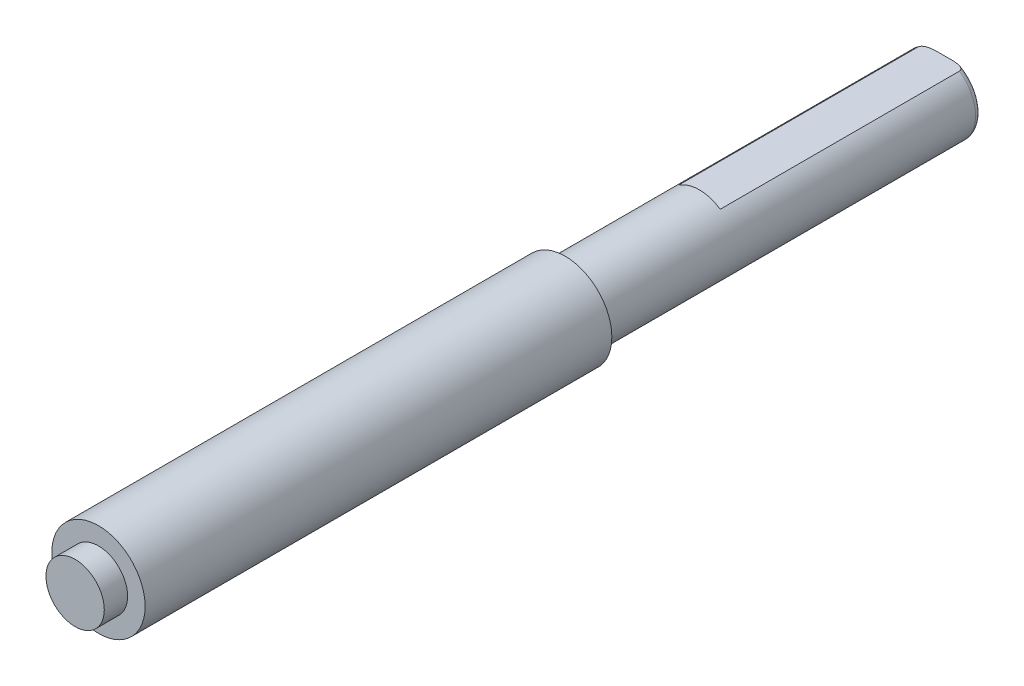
ISO-10303-21;
HEADER;
FILE_DESCRIPTION(('STEP AP214'),'2;1');
FILE_NAME('part.step','',(''),(''),'','','');
FILE_SCHEMA(('AUTOMOTIVE_DESIGN { 1 0 10303 214 1 1 1 1 }'));
ENDSEC;
DATA;
#1=APPLICATION_CONTEXT('core data for automotive mechanical design processes');
#2=APPLICATION_PROTOCOL_DEFINITION('international standard','automotive_design',2000,#1);
#3=PRODUCT_CONTEXT('',#1,'mechanical');
#4=PRODUCT('Part','Part','',(#3));
#5=PRODUCT_RELATED_PRODUCT_CATEGORY('part','',(#4));
#6=PRODUCT_DEFINITION_FORMATION('','',#4);
#7=PRODUCT_DEFINITION_CONTEXT('part definition',#1,'design');
#8=PRODUCT_DEFINITION('design','',#6,#7);
#9=PRODUCT_DEFINITION_SHAPE('','',#8);
#10=(LENGTH_UNIT() NAMED_UNIT(*) SI_UNIT(.MILLI.,.METRE.));
#11=(NAMED_UNIT(*) PLANE_ANGLE_UNIT() SI_UNIT($,.RADIAN.));
#12=(NAMED_UNIT(*) SI_UNIT($,.STERADIAN.) SOLID_ANGLE_UNIT());
#13=UNCERTAINTY_MEASURE_WITH_UNIT(LENGTH_MEASURE(1.E-05),#10,'distance_accuracy_value','');
#14=(GEOMETRIC_REPRESENTATION_CONTEXT(3) GLOBAL_UNCERTAINTY_ASSIGNED_CONTEXT((#13)) GLOBAL_UNIT_ASSIGNED_CONTEXT((#10,
#11,#12)) REPRESENTATION_CONTEXT('',''));
#15=CARTESIAN_POINT('',(0.,0.,0.));
#16=DIRECTION('',(0.,0.,1.));
#17=DIRECTION('',(1.,0.,0.));
#18=AXIS2_PLACEMENT_3D('',#15,#16,#17);
#19=CARTESIAN_POINT('',(0.,0.,72.5));
#20=DIRECTION('',(0.,0.,1.));
#21=DIRECTION('',(1.,0.,0.));
#22=AXIS2_PLACEMENT_3D('',#19,#20,#21);
#23=PLANE('',#22);
#24=CARTESIAN_POINT('',(0.,0.,72.5));
#25=DIRECTION('',(0.,0.,1.));
#26=DIRECTION('',(1.,0.,0.));
#27=AXIS2_PLACEMENT_3D('',#24,#25,#26);
#28=CIRCLE('',#27,4.);
#29=CARTESIAN_POINT('',(4.,0.,72.5));
#30=VERTEX_POINT('',#29);
#31=EDGE_CURVE('E88',#30,#30,#28,.T.);
#32=ORIENTED_EDGE('',*,*,#31,.T.);
#33=EDGE_LOOP('',(#32));
#34=FACE_BOUND('',#33,.T.);
#35=CARTESIAN_POINT('',(0.,0.,72.5));
#36=DIRECTION('',(0.,0.,1.));
#37=DIRECTION('',(1.,0.,0.));
#38=AXIS2_PLACEMENT_3D('',#35,#36,#37);
#39=CIRCLE('',#38,2.5);
#40=CARTESIAN_POINT('',(2.5,0.,72.5));
#41=VERTEX_POINT('',#40);
#42=EDGE_CURVE('E201',#41,#41,#39,.T.);
#43=ORIENTED_EDGE('',*,*,#42,.F.);
#44=EDGE_LOOP('',(#43));
#45=FACE_BOUND('',#44,.T.);
#46=ADVANCED_FACE('F33',(#34,#45),#23,.T.);
#47=CARTESIAN_POINT('',(0.,0.,32.5));
#48=DIRECTION('',(0.,0.,-1.));
#49=DIRECTION('',(-1.,0.,0.));
#50=AXIS2_PLACEMENT_3D('',#47,#48,#49);
#51=CYLINDRICAL_SURFACE('',#50,3.175);
#52=CARTESIAN_POINT('',(0.,0.,32.5));
#53=DIRECTION('',(0.,0.,1.));
#54=DIRECTION('',(1.,0.,0.));
#55=AXIS2_PLACEMENT_3D('',#52,#53,#54);
#56=CIRCLE('',#55,3.175);
#57=CARTESIAN_POINT('',(3.175,0.,32.5));
#58=VERTEX_POINT('',#57);
#59=EDGE_CURVE('E91',#58,#58,#56,.T.);
#60=ORIENTED_EDGE('',*,*,#59,.F.);
#61=EDGE_LOOP('',(#60));
#62=FACE_BOUND('',#61,.T.);
#63=DIRECTION('',(0.,0.,-1.));
#64=VECTOR('',#63,1.);
#65=CARTESIAN_POINT('',(-1.78605710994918,2.625,21.));
#66=LINE('',#65,#64);
#67=CARTESIAN_POINT('',(-1.78605710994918,2.625,21.));
#68=VERTEX_POINT('',#67);
#69=CARTESIAN_POINT('',(-1.78605710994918,2.625,0.500000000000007));
#70=VERTEX_POINT('',#69);
#71=EDGE_CURVE('E77',#68,#70,#66,.T.);
#72=ORIENTED_EDGE('',*,*,#71,.T.);
#73=CARTESIAN_POINT('',(0.,0.,0.5));
#74=DIRECTION('',(0.,0.,1.));
#75=DIRECTION('',(1.,0.,0.));
#76=AXIS2_PLACEMENT_3D('',#73,#74,#75);
#77=CIRCLE('',#76,3.175);
#78=CARTESIAN_POINT('',(1.78605710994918,2.625,0.500000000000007));
#79=VERTEX_POINT('',#78);
#80=EDGE_CURVE('E82',#70,#79,#77,.T.);
#81=ORIENTED_EDGE('',*,*,#80,.T.);
#82=DIRECTION('',(0.,0.,-1.));
#83=VECTOR('',#82,1.);
#84=CARTESIAN_POINT('',(1.78605710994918,2.625,21.));
#85=LINE('',#84,#83);
#86=CARTESIAN_POINT('',(1.78605710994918,2.625,21.));
#87=VERTEX_POINT('',#86);
#88=EDGE_CURVE('E76',#87,#79,#85,.T.);
#89=ORIENTED_EDGE('',*,*,#88,.F.);
#90=CARTESIAN_POINT('',(0.,0.,21.));
#91=DIRECTION('',(0.,0.,-1.));
#92=DIRECTION('',(-1.,0.,0.));
#93=AXIS2_PLACEMENT_3D('',#90,#91,#92);
#94=CIRCLE('',#93,3.175);
#95=EDGE_CURVE('E66',#68,#87,#94,.T.);
#96=ORIENTED_EDGE('',*,*,#95,.F.);
#97=EDGE_LOOP('',(#72,#81,#89,#96));
#98=FACE_BOUND('',#97,.T.);
#99=ADVANCED_FACE('F80',(#62,#98),#51,.T.);
#100=CARTESIAN_POINT('',(0.,0.,0.));
#101=DIRECTION('',(0.,0.,1.));
#102=DIRECTION('',(1.,0.,0.));
#103=AXIS2_PLACEMENT_3D('',#100,#101,#102);
#104=PLANE('',#103);
#105=DIRECTION('',(-1.,0.,0.));
#106=VECTOR('',#105,1.);
#107=CARTESIAN_POINT('',(1.78605710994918,2.625,0.));
#108=LINE('',#107,#106);
#109=CARTESIAN_POINT('',(0.514781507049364,2.625,0.));
#110=VERTEX_POINT('',#109);
#111=CARTESIAN_POINT('',(-0.514781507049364,2.625,0.));
#112=VERTEX_POINT('',#111);
#113=EDGE_CURVE('E73',#110,#112,#108,.T.);
#114=ORIENTED_EDGE('',*,*,#113,.F.);
#115=CARTESIAN_POINT('',(0.,0.,0.));
#116=DIRECTION('',(0.,0.,1.));
#117=DIRECTION('',(1.,0.,0.));
#118=AXIS2_PLACEMENT_3D('',#115,#116,#117);
#119=CIRCLE('',#118,2.675);
#120=EDGE_CURVE('E11',#110,#112,#119,.F.);
#121=ORIENTED_EDGE('',*,*,#120,.T.);
#122=EDGE_LOOP('',(#114,#121));
#123=FACE_BOUND('',#122,.T.);
#124=ADVANCED_FACE('F118',(#123),#104,.F.);
#125=CARTESIAN_POINT('',(0.,0.,32.5));
#126=DIRECTION('',(0.,0.,1.));
#127=DIRECTION('',(1.,0.,0.));
#128=AXIS2_PLACEMENT_3D('',#125,#126,#127);
#129=PLANE('',#128);
#130=CARTESIAN_POINT('',(0.,0.,32.5));
#131=DIRECTION('',(0.,0.,1.));
#132=DIRECTION('',(1.,0.,0.));
#133=AXIS2_PLACEMENT_3D('',#130,#131,#132);
#134=CIRCLE('',#133,4.);
#135=CARTESIAN_POINT('',(4.,0.,32.5));
#136=VERTEX_POINT('',#135);
#137=EDGE_CURVE('E84',#136,#136,#134,.T.);
#138=ORIENTED_EDGE('',*,*,#137,.F.);
#139=EDGE_LOOP('',(#138));
#140=FACE_BOUND('',#139,.T.);
#141=ORIENTED_EDGE('',*,*,#59,.T.);
#142=EDGE_LOOP('',(#141));
#143=FACE_BOUND('',#142,.T.);
#144=ADVANCED_FACE('F115',(#140,#143),#129,.F.);
#145=CARTESIAN_POINT('',(0.,0.,72.5));
#146=DIRECTION('',(0.,0.,-1.));
#147=DIRECTION('',(-1.,0.,0.));
#148=AXIS2_PLACEMENT_3D('',#145,#146,#147);
#149=CYLINDRICAL_SURFACE('',#148,4.);
#150=ORIENTED_EDGE('',*,*,#31,.F.);
#151=EDGE_LOOP('',(#150));
#152=FACE_BOUND('',#151,.T.);
#153=ORIENTED_EDGE('',*,*,#137,.T.);
#154=EDGE_LOOP('',(#153));
#155=FACE_BOUND('',#154,.T.);
#156=ADVANCED_FACE('F109',(#152,#155),#149,.T.);
#157=CARTESIAN_POINT('',(1.78605710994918,2.625,21.));
#158=DIRECTION('',(0.,-1.,0.));
#159=DIRECTION('',(0.,0.,-1.));
#160=AXIS2_PLACEMENT_3D('',#157,#158,#159);
#161=PLANE('',#160);
#162=ORIENTED_EDGE('',*,*,#88,.T.);
#163=CARTESIAN_POINT('',(1.78605710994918,2.625,0.5));
#164=CARTESIAN_POINT('',(1.7861183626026,2.625,0.480515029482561));
#165=CARTESIAN_POINT('',(1.78403706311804,2.625,0.461106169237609));
#166=CARTESIAN_POINT('',(1.77614566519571,2.625,0.423291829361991));
#167=CARTESIAN_POINT('',(1.77038040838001,2.625,0.404877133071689));
#168=CARTESIAN_POINT('',(1.75568721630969,2.625,0.369486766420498));
#169=CARTESIAN_POINT('',(1.74677356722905,2.625,0.352505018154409));
#170=CARTESIAN_POINT('',(1.72641804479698,2.625,0.320088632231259));
#171=CARTESIAN_POINT('',(1.71496821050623,2.625,0.304659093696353));
#172=CARTESIAN_POINT('',(1.68383170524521,2.625,0.26803343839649));
#173=CARTESIAN_POINT('',(1.66291485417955,2.625,0.247887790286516));
#174=CARTESIAN_POINT('',(1.61825721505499,2.625,0.211090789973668));
#175=CARTESIAN_POINT('',(1.59451232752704,2.625,0.194444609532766));
#176=CARTESIAN_POINT('',(1.52776741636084,2.625,0.153457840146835));
#177=CARTESIAN_POINT('',(1.48301267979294,2.625,0.131986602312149));
#178=CARTESIAN_POINT('',(1.41389871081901,2.625,0.104695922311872));
#179=CARTESIAN_POINT('',(1.39041958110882,2.625,0.0963921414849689));
#180=CARTESIAN_POINT('',(1.34299986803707,2.625,0.0812423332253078));
#181=CARTESIAN_POINT('',(1.31905952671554,2.625,0.074395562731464));
#182=CARTESIAN_POINT('',(1.23008070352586,2.625,0.0514093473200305));
#183=CARTESIAN_POINT('',(1.16404779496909,2.625,0.0391500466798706));
#184=CARTESIAN_POINT('',(1.03103589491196,2.625,0.0205768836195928));
#185=CARTESIAN_POINT('',(0.964054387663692,2.625,0.0142841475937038));
#186=CARTESIAN_POINT('',(0.833124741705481,2.625,0.00573297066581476));
#187=CARTESIAN_POINT('',(0.769187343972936,2.625,0.00329337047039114));
#188=CARTESIAN_POINT('',(0.67349457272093,2.625,0.0011481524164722));
#189=CARTESIAN_POINT('',(0.641749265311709,2.625,0.000684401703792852));
#190=CARTESIAN_POINT('',(0.578263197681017,2.625,0.000111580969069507));
#191=CARTESIAN_POINT('',(0.546522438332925,2.625,2.42149440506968E-06));
#192=CARTESIAN_POINT('',(0.514781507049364,2.625,0.));
#193=B_SPLINE_CURVE_WITH_KNOTS('',3,(#163,#164,#165,#166,#167,#168,#169,#170,#171,#172,#173,
#174,#175,#176,#177,#178,#179,#180,#181,#182,#183,#184,#185,#186,#187,#188,#189,#190,#191,#192),
.UNSPECIFIED.,.F.,.F.,(4,2,2,2,2,2,2,2,2,2,2,2,2,2,4),(0.,0.0582234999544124,0.115751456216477,
0.173021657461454,0.230474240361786,0.317101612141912,0.403856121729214,0.551884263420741,
0.62657755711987,0.701232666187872,0.90221485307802,1.10390604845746,1.29579765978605,
1.39104324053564,1.48626479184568),.UNSPECIFIED.);
#194=EDGE_CURVE('E42',#79,#110,#193,.T.);
#195=ORIENTED_EDGE('',*,*,#194,.T.);
#196=ORIENTED_EDGE('',*,*,#113,.T.);
#197=CARTESIAN_POINT('',(-0.514781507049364,2.625,0.));
#198=CARTESIAN_POINT('',(-0.545138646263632,2.625,1.99675866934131E-06));
#199=CARTESIAN_POINT('',(-0.575495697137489,2.625,0.00010207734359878));
#200=CARTESIAN_POINT('',(-0.63621318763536,2.625,0.000620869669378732));
#201=CARTESIAN_POINT('',(-0.666573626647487,2.625,0.00103964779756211));
#202=CARTESIAN_POINT('',(-0.757972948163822,2.625,0.00296465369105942));
#203=CARTESIAN_POINT('',(-0.819003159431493,2.625,0.00514219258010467));
#204=CARTESIAN_POINT('',(-0.941825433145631,2.625,0.0125778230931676));
#205=CARTESIAN_POINT('',(-1.00361494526,2.625,0.0178823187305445));
#206=CARTESIAN_POINT('',(-1.12651560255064,2.625,0.0332527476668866));
#207=CARTESIAN_POINT('',(-1.18762806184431,2.625,0.0433066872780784));
#208=CARTESIAN_POINT('',(-1.28243856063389,2.625,0.0645844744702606));
#209=CARTESIAN_POINT('',(-1.31665689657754,2.625,0.0734587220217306));
#210=CARTESIAN_POINT('',(-1.38423460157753,2.625,0.0940301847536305));
#211=CARTESIAN_POINT('',(-1.41759448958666,2.625,0.105725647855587));
#212=CARTESIAN_POINT('',(-1.48318231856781,2.625,0.132705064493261));
#213=CARTESIAN_POINT('',(-1.51539860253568,2.625,0.148017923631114));
#214=CARTESIAN_POINT('',(-1.57740901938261,2.625,0.182992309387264));
#215=CARTESIAN_POINT('',(-1.60720754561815,2.625,0.202645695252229));
#216=CARTESIAN_POINT('',(-1.65201841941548,2.625,0.238603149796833));
#217=CARTESIAN_POINT('',(-1.66831627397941,2.625,0.253297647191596));
#218=CARTESIAN_POINT('',(-1.69872512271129,2.625,0.28482495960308));
#219=CARTESIAN_POINT('',(-1.71283757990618,2.625,0.301656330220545));
#220=CARTESIAN_POINT('',(-1.73617877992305,2.625,0.334788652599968));
#221=CARTESIAN_POINT('',(-1.74582188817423,2.625,0.350794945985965));
#222=CARTESIAN_POINT('',(-1.76232487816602,2.625,0.38416491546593));
#223=CARTESIAN_POINT('',(-1.76919194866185,2.625,0.401524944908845));
#224=CARTESIAN_POINT('',(-1.77820439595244,2.625,0.432417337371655));
#225=CARTESIAN_POINT('',(-1.78112252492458,2.625,0.445725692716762));
#226=CARTESIAN_POINT('',(-1.78506131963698,2.625,0.472682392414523));
#227=CARTESIAN_POINT('',(-1.78607295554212,2.625,0.486332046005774));
#228=CARTESIAN_POINT('',(-1.78605710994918,2.625,0.500000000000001));
#229=B_SPLINE_CURVE_WITH_KNOTS('',3,(#197,#198,#199,#200,#201,#202,#203,#204,#205,#206,#207,
#208,#209,#210,#211,#212,#213,#214,#215,#216,#217,#218,#219,#220,#221,#222,#223,#224,#225,#226,
#227,#228),.UNSPECIFIED.,.F.,.F.,(4,2,2,2,2,2,2,2,2,2,2,2,2,2,2,4),(0.,0.091070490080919,
0.182159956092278,0.365318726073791,0.551266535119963,0.736747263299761,0.842706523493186,
0.948600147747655,1.05537040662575,1.16194209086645,1.22761113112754,1.2932360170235,
1.34908253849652,1.40478350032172,1.44552659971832,1.4864621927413),.UNSPECIFIED.);
#230=EDGE_CURVE('E97',#112,#70,#229,.T.);
#231=ORIENTED_EDGE('',*,*,#230,.T.);
#232=ORIENTED_EDGE('',*,*,#71,.F.);
#233=DIRECTION('',(-1.,0.,0.));
#234=VECTOR('',#233,1.);
#235=CARTESIAN_POINT('',(1.78605710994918,2.625,21.));
#236=LINE('',#235,#234);
#237=EDGE_CURVE('E69',#87,#68,#236,.T.);
#238=ORIENTED_EDGE('',*,*,#237,.F.);
#239=EDGE_LOOP('',(#162,#195,#196,#231,#232,#238));
#240=FACE_BOUND('',#239,.T.);
#241=ADVANCED_FACE('F75',(#240),#161,.F.);
#242=CARTESIAN_POINT('',(0.,0.,21.));
#243=DIRECTION('',(0.,0.,-1.));
#244=DIRECTION('',(-1.,0.,0.));
#245=AXIS2_PLACEMENT_3D('',#242,#243,#244);
#246=PLANE('',#245);
#247=ORIENTED_EDGE('',*,*,#95,.T.);
#248=ORIENTED_EDGE('',*,*,#237,.T.);
#249=EDGE_LOOP('',(#247,#248));
#250=FACE_BOUND('',#249,.T.);
#251=ADVANCED_FACE('F68',(#250),#246,.T.);
#252=CARTESIAN_POINT('',(0.,0.,74.5));
#253=DIRECTION('',(0.,0.,-1.));
#254=DIRECTION('',(-1.,0.,0.));
#255=AXIS2_PLACEMENT_3D('',#252,#253,#254);
#256=CYLINDRICAL_SURFACE('',#255,2.5);
#257=CARTESIAN_POINT('',(0.,0.,74.5));
#258=DIRECTION('',(0.,0.,1.));
#259=DIRECTION('',(1.,0.,0.));
#260=AXIS2_PLACEMENT_3D('',#257,#258,#259);
#261=CIRCLE('',#260,2.5);
#262=CARTESIAN_POINT('',(2.5,0.,74.5));
#263=VERTEX_POINT('',#262);
#264=EDGE_CURVE('E199',#263,#263,#261,.T.);
#265=ORIENTED_EDGE('',*,*,#264,.F.);
#266=EDGE_LOOP('',(#265));
#267=FACE_BOUND('',#266,.T.);
#268=ORIENTED_EDGE('',*,*,#42,.T.);
#269=EDGE_LOOP('',(#268));
#270=FACE_BOUND('',#269,.T.);
#271=ADVANCED_FACE('F156',(#267,#270),#256,.T.);
#272=CARTESIAN_POINT('',(0.,0.,74.5));
#273=DIRECTION('',(0.,0.,1.));
#274=DIRECTION('',(1.,0.,0.));
#275=AXIS2_PLACEMENT_3D('',#272,#273,#274);
#276=PLANE('',#275);
#277=ORIENTED_EDGE('',*,*,#264,.T.);
#278=EDGE_LOOP('',(#277));
#279=FACE_BOUND('',#278,.T.);
#280=ADVANCED_FACE('F162',(#279),#276,.T.);
#281=CARTESIAN_POINT('',(0.,0.,0.5));
#282=DIRECTION('',(0.,0.,1.));
#283=DIRECTION('',(1.,0.,0.));
#284=AXIS2_PLACEMENT_3D('',#281,#282,#283);
#285=TOROIDAL_SURFACE('',#284,2.675,0.5);
#286=ORIENTED_EDGE('',*,*,#230,.F.);
#287=ORIENTED_EDGE('',*,*,#120,.F.);
#288=ORIENTED_EDGE('',*,*,#194,.F.);
#289=ORIENTED_EDGE('',*,*,#80,.F.);
#290=EDGE_LOOP('',(#286,#287,#288,#289));
#291=FACE_BOUND('',#290,.T.);
#292=ADVANCED_FACE('F35',(#291),#285,.T.);
#293=CLOSED_SHELL('',(#46,#99,#124,#144,#156,#241,#251,#271,#280,#292));
#294=MANIFOLD_SOLID_BREP('B2',#293);
#295=ADVANCED_BREP_SHAPE_REPRESENTATION('',(#18,#294),#14);
#296=SHAPE_DEFINITION_REPRESENTATION(#9,#295);
ENDSEC;
END-ISO-10303-21;
